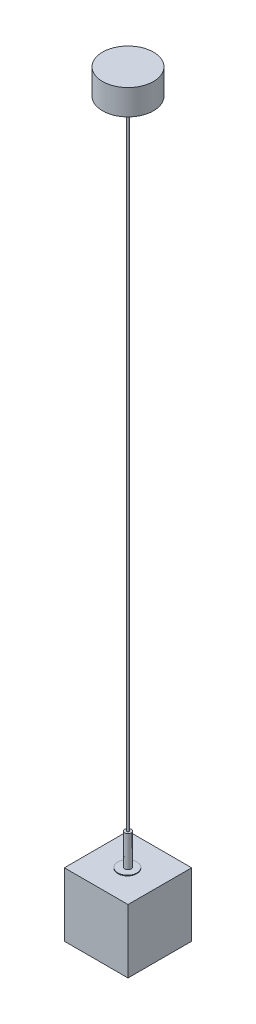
from build123d import *

# Parameters (mm, degrees)
CROQUIS1_W              = 100
CROQUIS1_H              = 100
SALIENTE_EXTRUIR1_DEPTH = 100
VACIADO1_T              = -2
CROQUIS3_R              = 5
SALIENTE_EXTRUIR2_DEPTH = 50
CROQUIS4_R              = 1.5
SALIENTE_EXTRUIR3_DEPTH = 1000
CROQUIS5_R              = 40
SALIENTE_EXTRUIR4_DEPTH = 40
CROQUIS6_R              = 15
CROQUIS6_R_2            = 5
SALIENTE_EXTRUIR5_DEPTH = 1


with BuildPart() as part:
    # Croquis1 → Saliente-Extruir1 (new body)
    with BuildSketch(Plane(origin=(0, 0, 0), x_dir=(1, 0, 0), z_dir=(0, 1, 0))):
        Rectangle(CROQUIS1_W, CROQUIS1_H)
    extrude(amount=SALIENTE_EXTRUIR1_DEPTH)

    # Vaciado1
    vaciado1_openings = [part.faces().sort_by_distance(p)[0] for p in [
        (0, 0, 0),
    ]]
    offset(amount=VACIADO1_T, openings=vaciado1_openings, kind=Kind.INTERSECTION)


with BuildPart() as body_2:
    # Croquis3 → Saliente-Extruir2 (new body)
    with BuildSketch(Plane(origin=(0, 100, 0), x_dir=(1, 0, 0), z_dir=(0, 1, 0))):
        with Locations(Location((0, 0, 0), (0, 0, 270))):
            Circle(CROQUIS3_R)
    extrude(amount=SALIENTE_EXTRUIR2_DEPTH)


with BuildPart() as body_3:
    # Croquis4 → Saliente-Extruir3 (new body)
    with BuildSketch(Plane(origin=(0, 150, 0), x_dir=(1, 0, 0), z_dir=(0, 1, 0))):
        with Locations(Location((0, 0, 0), (0, 0, 270))):
            Circle(CROQUIS4_R)
    extrude(amount=SALIENTE_EXTRUIR3_DEPTH)


with BuildPart() as body_4:
    # Croquis5 → Saliente-Extruir4 (new body)
    with BuildSketch(Plane(origin=(0, 1150, 0), x_dir=(1, 0, 0), z_dir=(0, 1, 0))):
        with Locations(Location((0, 0, 0), (0, 0, 270))):
            Circle(CROQUIS5_R)
    extrude(amount=SALIENTE_EXTRUIR4_DEPTH)


with BuildPart() as body_5:
    # Croquis6 → Saliente-Extruir5 (new body)
    with BuildSketch(Plane(origin=(0, 100, 0), x_dir=(1, 0, 0), z_dir=(0, 1, 0))):
        with Locations(Location((0, -1.017482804, 0), (0, 0, 270))):
            Circle(CROQUIS6_R)
        with Locations(Location((0, 0, 0), (0, 0, 270))):
            Circle(CROQUIS6_R_2, mode=Mode.SUBTRACT)
    extrude(amount=SALIENTE_EXTRUIR5_DEPTH)


solid = Compound([part.part, body_2.part, body_3.part, body_4.part, body_5.part])
